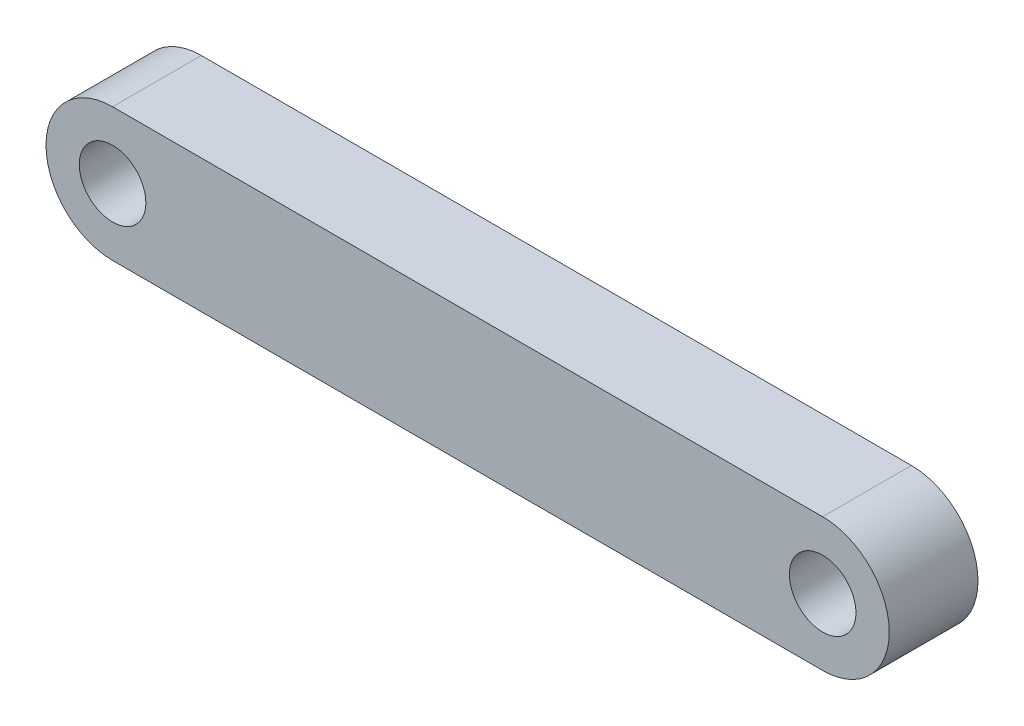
from build123d import *

# Parameters (mm, degrees)
SKETCH1_R          = 9.525
BASE_EXTRUDE_DEPTH = 12.7


with BuildPart() as part:
    # Sketch1 → Base-Extrude (new, symmetric)
    with BuildSketch(Plane.XY):
        with BuildLine():
            Line((0, 19.05), (203.2, 19.05))
            ThreePointArc((203.2, 19.05), (222.25, 0), (203.2, -19.05))
            Line((203.2, -19.05), (0, -19.05))
            ThreePointArc((0, -19.05), (-19.05, 0), (0, 19.05))
        make_face()
        with Locations((203.2, 0)):
            Circle(SKETCH1_R, mode=Mode.SUBTRACT)
        Circle(SKETCH1_R, mode=Mode.SUBTRACT)
    extrude(amount=BASE_EXTRUDE_DEPTH, both=True)


solid = part.part
